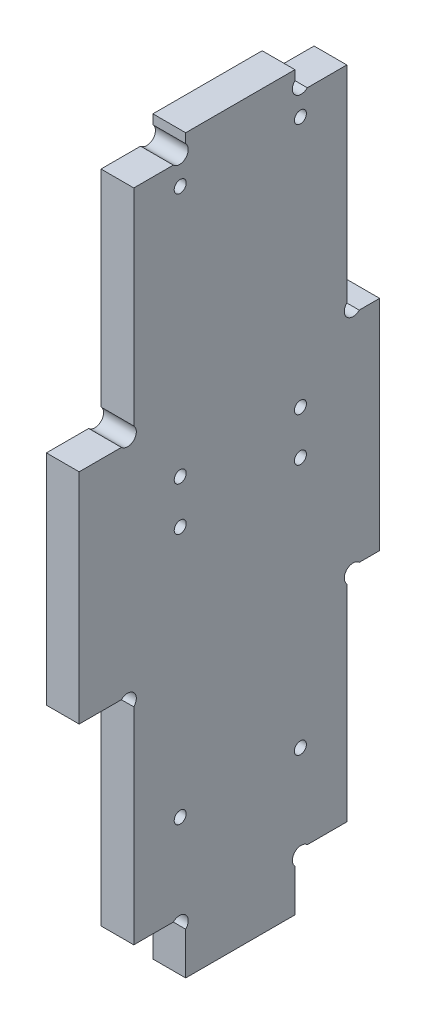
ISO-10303-21;
HEADER;
FILE_DESCRIPTION(('STEP AP214'),'2;1');
FILE_NAME('part.step','',(''),(''),'','','');
FILE_SCHEMA(('AUTOMOTIVE_DESIGN { 1 0 10303 214 1 1 1 1 }'));
ENDSEC;
DATA;
#1=APPLICATION_CONTEXT('core data for automotive mechanical design processes');
#2=APPLICATION_PROTOCOL_DEFINITION('international standard','automotive_design',2000,#1);
#3=PRODUCT_CONTEXT('',#1,'mechanical');
#4=PRODUCT('Part','Part','',(#3));
#5=PRODUCT_RELATED_PRODUCT_CATEGORY('part','',(#4));
#6=PRODUCT_DEFINITION_FORMATION('','',#4);
#7=PRODUCT_DEFINITION_CONTEXT('part definition',#1,'design');
#8=PRODUCT_DEFINITION('design','',#6,#7);
#9=PRODUCT_DEFINITION_SHAPE('','',#8);
#10=(LENGTH_UNIT() NAMED_UNIT(*) SI_UNIT(.MILLI.,.METRE.));
#11=(NAMED_UNIT(*) PLANE_ANGLE_UNIT() SI_UNIT($,.RADIAN.));
#12=(NAMED_UNIT(*) SI_UNIT($,.STERADIAN.) SOLID_ANGLE_UNIT());
#13=UNCERTAINTY_MEASURE_WITH_UNIT(LENGTH_MEASURE(1.E-05),#10,'distance_accuracy_value','');
#14=(GEOMETRIC_REPRESENTATION_CONTEXT(3) GLOBAL_UNCERTAINTY_ASSIGNED_CONTEXT((#13)) GLOBAL_UNIT_ASSIGNED_CONTEXT((#10,
#11,#12)) REPRESENTATION_CONTEXT('',''));
#15=CARTESIAN_POINT('',(0.,0.,0.));
#16=DIRECTION('',(0.,0.,1.));
#17=DIRECTION('',(1.,0.,0.));
#18=AXIS2_PLACEMENT_3D('',#15,#16,#17);
#19=CARTESIAN_POINT('',(6.,48.8686291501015,-50.1313708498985));
#20=DIRECTION('',(1.,0.,0.));
#21=DIRECTION('',(0.,0.,-1.));
#22=AXIS2_PLACEMENT_3D('',#19,#20,#21);
#23=PLANE('',#22);
#24=CARTESIAN_POINT('',(6.,26.,-40.5));
#25=DIRECTION('',(1.,0.,0.));
#26=DIRECTION('',(0.,0.,-1.));
#27=AXIS2_PLACEMENT_3D('',#24,#25,#26);
#28=CIRCLE('',#27,1.1);
#29=CARTESIAN_POINT('',(6.,26.,-41.6));
#30=VERTEX_POINT('',#29);
#31=EDGE_CURVE('E611',#30,#30,#28,.T.);
#32=ORIENTED_EDGE('',*,*,#31,.F.);
#33=EDGE_LOOP('',(#32));
#34=FACE_BOUND('',#33,.T.);
#35=CARTESIAN_POINT('',(6.,72.,-18.5));
#36=DIRECTION('',(1.,0.,0.));
#37=DIRECTION('',(0.,0.,1.));
#38=AXIS2_PLACEMENT_3D('',#35,#36,#37);
#39=CIRCLE('',#38,1.1);
#40=CARTESIAN_POINT('',(6.,72.,-17.4));
#41=VERTEX_POINT('',#40);
#42=EDGE_CURVE('E623',#41,#41,#39,.T.);
#43=ORIENTED_EDGE('',*,*,#42,.F.);
#44=EDGE_LOOP('',(#43));
#45=FACE_BOUND('',#44,.T.);
#46=CARTESIAN_POINT('',(6.,126.,-40.5));
#47=DIRECTION('',(1.,0.,0.));
#48=DIRECTION('',(0.,0.,1.));
#49=AXIS2_PLACEMENT_3D('',#46,#47,#48);
#50=CIRCLE('',#49,1.1);
#51=CARTESIAN_POINT('',(6.,126.,-39.4));
#52=VERTEX_POINT('',#51);
#53=EDGE_CURVE('E635',#52,#52,#50,.T.);
#54=ORIENTED_EDGE('',*,*,#53,.F.);
#55=EDGE_LOOP('',(#54));
#56=FACE_BOUND('',#55,.T.);
#57=CARTESIAN_POINT('',(6.,126.,-18.5));
#58=DIRECTION('',(1.,0.,0.));
#59=DIRECTION('',(0.,0.,-1.));
#60=AXIS2_PLACEMENT_3D('',#57,#58,#59);
#61=CIRCLE('',#60,1.1);
#62=CARTESIAN_POINT('',(6.,126.,-19.6));
#63=VERTEX_POINT('',#62);
#64=EDGE_CURVE('E237',#63,#63,#61,.T.);
#65=ORIENTED_EDGE('',*,*,#64,.F.);
#66=EDGE_LOOP('',(#65));
#67=FACE_BOUND('',#66,.T.);
#68=CARTESIAN_POINT('',(6.,48.8686291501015,-50.1313708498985));
#69=DIRECTION('',(-1.,0.,0.));
#70=DIRECTION('',(0.,0.,-1.));
#71=AXIS2_PLACEMENT_3D('',#68,#69,#70);
#72=CIRCLE('',#71,1.6);
#73=CARTESIAN_POINT('',(6.,47.7372583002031,-49.));
#74=VERTEX_POINT('',#73);
#75=CARTESIAN_POINT('',(6.,50.,-51.262741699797));
#76=VERTEX_POINT('',#75);
#77=EDGE_CURVE('E295',#74,#76,#72,.T.);
#78=ORIENTED_EDGE('',*,*,#77,.T.);
#79=DIRECTION('',(0.,0.,-1.));
#80=VECTOR('',#79,1.);
#81=CARTESIAN_POINT('',(6.,50.,-51.262741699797));
#82=LINE('',#81,#80);
#83=CARTESIAN_POINT('',(6.,50.,-55.));
#84=VERTEX_POINT('',#83);
#85=EDGE_CURVE('E232',#76,#84,#82,.T.);
#86=ORIENTED_EDGE('',*,*,#85,.T.);
#87=DIRECTION('',(0.,1.,0.));
#88=VECTOR('',#87,1.);
#89=CARTESIAN_POINT('',(6.,90.,-55.));
#90=LINE('',#89,#88);
#91=CARTESIAN_POINT('',(6.,90.,-55.));
#92=VERTEX_POINT('',#91);
#93=EDGE_CURVE('E298',#84,#92,#90,.T.);
#94=ORIENTED_EDGE('',*,*,#93,.T.);
#95=DIRECTION('',(0.,0.,1.));
#96=VECTOR('',#95,1.);
#97=CARTESIAN_POINT('',(6.,90.,-51.262741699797));
#98=LINE('',#97,#96);
#99=CARTESIAN_POINT('',(6.,90.,-51.262741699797));
#100=VERTEX_POINT('',#99);
#101=EDGE_CURVE('E300',#92,#100,#98,.T.);
#102=ORIENTED_EDGE('',*,*,#101,.T.);
#103=CARTESIAN_POINT('',(6.,91.1313708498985,-50.1313708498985));
#104=DIRECTION('',(-1.,0.,0.));
#105=DIRECTION('',(0.,0.,1.));
#106=AXIS2_PLACEMENT_3D('',#103,#104,#105);
#107=CIRCLE('',#106,1.59999999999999);
#108=CARTESIAN_POINT('',(6.,92.2627416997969,-49.));
#109=VERTEX_POINT('',#108);
#110=EDGE_CURVE('E302',#100,#109,#107,.T.);
#111=ORIENTED_EDGE('',*,*,#110,.T.);
#112=DIRECTION('',(0.,1.,0.));
#113=VECTOR('',#112,1.);
#114=CARTESIAN_POINT('',(6.,130.,-49.));
#115=LINE('',#114,#113);
#116=CARTESIAN_POINT('',(6.,130.,-49.));
#117=VERTEX_POINT('',#116);
#118=EDGE_CURVE('E304',#109,#117,#115,.T.);
#119=ORIENTED_EDGE('',*,*,#118,.T.);
#120=DIRECTION('',(0.,0.,1.));
#121=VECTOR('',#120,1.);
#122=CARTESIAN_POINT('',(6.,130.,-41.7627416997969));
#123=LINE('',#122,#121);
#124=CARTESIAN_POINT('',(6.,130.,-41.7627416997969));
#125=VERTEX_POINT('',#124);
#126=EDGE_CURVE('E306',#117,#125,#123,.T.);
#127=ORIENTED_EDGE('',*,*,#126,.T.);
#128=CARTESIAN_POINT('',(6.,131.131370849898,-40.6313708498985));
#129=DIRECTION('',(-1.,0.,0.));
#130=DIRECTION('',(0.,0.,1.));
#131=AXIS2_PLACEMENT_3D('',#128,#129,#130);
#132=CIRCLE('',#131,1.59999999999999);
#133=CARTESIAN_POINT('',(6.,132.262741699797,-39.5));
#134=VERTEX_POINT('',#133);
#135=EDGE_CURVE('E308',#125,#134,#132,.T.);
#136=ORIENTED_EDGE('',*,*,#135,.T.);
#137=DIRECTION('',(0.,1.,0.));
#138=VECTOR('',#137,1.);
#139=CARTESIAN_POINT('',(6.,132.262741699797,-39.5));
#140=LINE('',#139,#138);
#141=CARTESIAN_POINT('',(6.,134.,-39.5));
#142=VERTEX_POINT('',#141);
#143=EDGE_CURVE('E310',#134,#142,#140,.T.);
#144=ORIENTED_EDGE('',*,*,#143,.T.);
#145=DIRECTION('',(0.,0.,1.));
#146=VECTOR('',#145,1.);
#147=CARTESIAN_POINT('',(6.,134.,-19.5));
#148=LINE('',#147,#146);
#149=CARTESIAN_POINT('',(6.,134.,-19.5));
#150=VERTEX_POINT('',#149);
#151=EDGE_CURVE('E312',#142,#150,#148,.T.);
#152=ORIENTED_EDGE('',*,*,#151,.T.);
#153=DIRECTION('',(0.,-1.,0.));
#154=VECTOR('',#153,1.);
#155=CARTESIAN_POINT('',(6.,132.262741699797,-19.5));
#156=LINE('',#155,#154);
#157=CARTESIAN_POINT('',(6.,132.262741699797,-19.5));
#158=VERTEX_POINT('',#157);
#159=EDGE_CURVE('E314',#150,#158,#156,.T.);
#160=ORIENTED_EDGE('',*,*,#159,.T.);
#161=CARTESIAN_POINT('',(6.,131.131370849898,-18.3686291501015));
#162=DIRECTION('',(-1.,0.,0.));
#163=DIRECTION('',(0.,0.,-1.));
#164=AXIS2_PLACEMENT_3D('',#161,#162,#163);
#165=CIRCLE('',#164,1.59999999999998);
#166=CARTESIAN_POINT('',(6.,130.,-17.2372583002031));
#167=VERTEX_POINT('',#166);
#168=EDGE_CURVE('E316',#158,#167,#165,.T.);
#169=ORIENTED_EDGE('',*,*,#168,.T.);
#170=DIRECTION('',(0.,0.,1.));
#171=VECTOR('',#170,1.);
#172=CARTESIAN_POINT('',(6.,130.,-10.));
#173=LINE('',#172,#171);
#174=CARTESIAN_POINT('',(6.,130.,-10.));
#175=VERTEX_POINT('',#174);
#176=EDGE_CURVE('E318',#167,#175,#173,.T.);
#177=ORIENTED_EDGE('',*,*,#176,.T.);
#178=DIRECTION('',(0.,-1.,0.));
#179=VECTOR('',#178,1.);
#180=CARTESIAN_POINT('',(6.,92.2627416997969,-10.));
#181=LINE('',#180,#179);
#182=CARTESIAN_POINT('',(6.,92.2627416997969,-10.));
#183=VERTEX_POINT('',#182);
#184=EDGE_CURVE('E320',#175,#183,#181,.T.);
#185=ORIENTED_EDGE('',*,*,#184,.T.);
#186=CARTESIAN_POINT('',(6.,91.1313708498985,-8.86862915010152));
#187=DIRECTION('',(-1.,0.,0.));
#188=DIRECTION('',(0.,0.,1.));
#189=AXIS2_PLACEMENT_3D('',#186,#187,#188);
#190=CIRCLE('',#189,1.6);
#191=CARTESIAN_POINT('',(6.,90.,-7.73725830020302));
#192=VERTEX_POINT('',#191);
#193=EDGE_CURVE('E322',#183,#192,#190,.T.);
#194=ORIENTED_EDGE('',*,*,#193,.T.);
#195=DIRECTION('',(0.,0.,1.));
#196=VECTOR('',#195,1.);
#197=CARTESIAN_POINT('',(6.,90.,-7.73725830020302));
#198=LINE('',#197,#196);
#199=CARTESIAN_POINT('',(6.,90.,0.));
#200=VERTEX_POINT('',#199);
#201=EDGE_CURVE('E324',#192,#200,#198,.T.);
#202=ORIENTED_EDGE('',*,*,#201,.T.);
#203=DIRECTION('',(0.,-1.,0.));
#204=VECTOR('',#203,1.);
#205=CARTESIAN_POINT('',(6.,50.,0.));
#206=LINE('',#205,#204);
#207=CARTESIAN_POINT('',(6.,50.,0.));
#208=VERTEX_POINT('',#207);
#209=EDGE_CURVE('E326',#200,#208,#206,.T.);
#210=ORIENTED_EDGE('',*,*,#209,.T.);
#211=DIRECTION('',(0.,0.,-1.));
#212=VECTOR('',#211,1.);
#213=CARTESIAN_POINT('',(6.,50.,-7.73725830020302));
#214=LINE('',#213,#212);
#215=CARTESIAN_POINT('',(6.,50.,-7.73725830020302));
#216=VERTEX_POINT('',#215);
#217=EDGE_CURVE('E328',#208,#216,#214,.T.);
#218=ORIENTED_EDGE('',*,*,#217,.T.);
#219=CARTESIAN_POINT('',(6.,48.8686291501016,-8.86862915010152));
#220=DIRECTION('',(-1.,0.,0.));
#221=DIRECTION('',(0.,0.,-1.));
#222=AXIS2_PLACEMENT_3D('',#219,#220,#221);
#223=CIRCLE('',#222,1.6);
#224=CARTESIAN_POINT('',(6.,47.7372583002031,-10.));
#225=VERTEX_POINT('',#224);
#226=EDGE_CURVE('E330',#216,#225,#223,.T.);
#227=ORIENTED_EDGE('',*,*,#226,.T.);
#228=DIRECTION('',(0.,-1.,0.));
#229=VECTOR('',#228,1.);
#230=CARTESIAN_POINT('',(6.,10.,-10.));
#231=LINE('',#230,#229);
#232=CARTESIAN_POINT('',(6.,10.,-10.));
#233=VERTEX_POINT('',#232);
#234=EDGE_CURVE('E332',#225,#233,#231,.T.);
#235=ORIENTED_EDGE('',*,*,#234,.T.);
#236=DIRECTION('',(0.,0.,-1.));
#237=VECTOR('',#236,1.);
#238=CARTESIAN_POINT('',(6.,10.,-17.237258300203));
#239=LINE('',#238,#237);
#240=CARTESIAN_POINT('',(6.,10.,-17.237258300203));
#241=VERTEX_POINT('',#240);
#242=EDGE_CURVE('E334',#233,#241,#239,.T.);
#243=ORIENTED_EDGE('',*,*,#242,.T.);
#244=CARTESIAN_POINT('',(6.,8.86862915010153,-18.3686291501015));
#245=DIRECTION('',(-1.,0.,0.));
#246=DIRECTION('',(0.,0.,-1.));
#247=AXIS2_PLACEMENT_3D('',#244,#245,#246);
#248=CIRCLE('',#247,1.6);
#249=CARTESIAN_POINT('',(6.,7.73725830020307,-19.5));
#250=VERTEX_POINT('',#249);
#251=EDGE_CURVE('E336',#241,#250,#248,.T.);
#252=ORIENTED_EDGE('',*,*,#251,.T.);
#253=DIRECTION('',(0.,-1.,0.));
#254=VECTOR('',#253,1.);
#255=CARTESIAN_POINT('',(6.,7.73725830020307,-19.5));
#256=LINE('',#255,#254);
#257=CARTESIAN_POINT('',(6.,0.,-19.5));
#258=VERTEX_POINT('',#257);
#259=EDGE_CURVE('E338',#250,#258,#256,.T.);
#260=ORIENTED_EDGE('',*,*,#259,.T.);
#261=DIRECTION('',(0.,0.,-1.));
#262=VECTOR('',#261,1.);
#263=CARTESIAN_POINT('',(6.,0.,-19.5));
#264=LINE('',#263,#262);
#265=CARTESIAN_POINT('',(6.,0.,-39.5));
#266=VERTEX_POINT('',#265);
#267=EDGE_CURVE('E340',#258,#266,#264,.T.);
#268=ORIENTED_EDGE('',*,*,#267,.T.);
#269=DIRECTION('',(0.,1.,0.));
#270=VECTOR('',#269,1.);
#271=CARTESIAN_POINT('',(6.,7.73725830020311,-39.5));
#272=LINE('',#271,#270);
#273=CARTESIAN_POINT('',(6.,7.73725830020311,-39.5));
#274=VERTEX_POINT('',#273);
#275=EDGE_CURVE('E342',#266,#274,#272,.T.);
#276=ORIENTED_EDGE('',*,*,#275,.T.);
#277=CARTESIAN_POINT('',(6.,8.86862915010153,-40.6313708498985));
#278=DIRECTION('',(-1.,0.,0.));
#279=DIRECTION('',(0.,0.,1.));
#280=AXIS2_PLACEMENT_3D('',#277,#278,#279);
#281=CIRCLE('',#280,1.6);
#282=CARTESIAN_POINT('',(6.,10.,-41.762741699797));
#283=VERTEX_POINT('',#282);
#284=EDGE_CURVE('E344',#274,#283,#281,.T.);
#285=ORIENTED_EDGE('',*,*,#284,.T.);
#286=DIRECTION('',(0.,0.,-1.));
#287=VECTOR('',#286,1.);
#288=CARTESIAN_POINT('',(6.,10.,-41.762741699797));
#289=LINE('',#288,#287);
#290=CARTESIAN_POINT('',(6.,10.,-49.));
#291=VERTEX_POINT('',#290);
#292=EDGE_CURVE('E53',#283,#291,#289,.T.);
#293=ORIENTED_EDGE('',*,*,#292,.T.);
#294=DIRECTION('',(0.,1.,0.));
#295=VECTOR('',#294,1.);
#296=CARTESIAN_POINT('',(6.,10.,-49.));
#297=LINE('',#296,#295);
#298=EDGE_CURVE('E48',#291,#74,#297,.T.);
#299=ORIENTED_EDGE('',*,*,#298,.T.);
#300=EDGE_LOOP('',(#78,#86,#94,#102,#111,#119,#127,#136,#144,#152,#160,#169,#177,#185,#194,#202,
#210,#218,#227,#235,#243,#252,#260,#268,#276,#285,#293,#299));
#301=FACE_BOUND('',#300,.T.);
#302=CARTESIAN_POINT('',(6.,80.,-18.5));
#303=DIRECTION('',(1.,0.,0.));
#304=DIRECTION('',(0.,0.,-1.));
#305=AXIS2_PLACEMENT_3D('',#302,#303,#304);
#306=CIRCLE('',#305,1.1);
#307=CARTESIAN_POINT('',(6.,80.,-19.6));
#308=VERTEX_POINT('',#307);
#309=EDGE_CURVE('E641',#308,#308,#306,.T.);
#310=ORIENTED_EDGE('',*,*,#309,.F.);
#311=EDGE_LOOP('',(#310));
#312=FACE_BOUND('',#311,.T.);
#313=CARTESIAN_POINT('',(6.,80.,-40.5));
#314=DIRECTION('',(1.,0.,0.));
#315=DIRECTION('',(0.,0.,1.));
#316=AXIS2_PLACEMENT_3D('',#313,#314,#315);
#317=CIRCLE('',#316,1.09999999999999);
#318=CARTESIAN_POINT('',(6.,80.,-39.4));
#319=VERTEX_POINT('',#318);
#320=EDGE_CURVE('E629',#319,#319,#317,.T.);
#321=ORIENTED_EDGE('',*,*,#320,.F.);
#322=EDGE_LOOP('',(#321));
#323=FACE_BOUND('',#322,.T.);
#324=CARTESIAN_POINT('',(6.,72.,-40.5));
#325=DIRECTION('',(1.,0.,0.));
#326=DIRECTION('',(0.,0.,-1.));
#327=AXIS2_PLACEMENT_3D('',#324,#325,#326);
#328=CIRCLE('',#327,1.09999999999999);
#329=CARTESIAN_POINT('',(6.,72.,-41.6));
#330=VERTEX_POINT('',#329);
#331=EDGE_CURVE('E617',#330,#330,#328,.T.);
#332=ORIENTED_EDGE('',*,*,#331,.F.);
#333=EDGE_LOOP('',(#332));
#334=FACE_BOUND('',#333,.T.);
#335=CARTESIAN_POINT('',(6.,26.,-18.5));
#336=DIRECTION('',(1.,0.,0.));
#337=DIRECTION('',(0.,0.,1.));
#338=AXIS2_PLACEMENT_3D('',#335,#336,#337);
#339=CIRCLE('',#338,1.1);
#340=CARTESIAN_POINT('',(6.,26.,-17.4));
#341=VERTEX_POINT('',#340);
#342=EDGE_CURVE('E600',#341,#341,#339,.T.);
#343=ORIENTED_EDGE('',*,*,#342,.F.);
#344=EDGE_LOOP('',(#343));
#345=FACE_BOUND('',#344,.T.);
#346=ADVANCED_FACE('F33',(#34,#45,#56,#67,#301,#312,#323,#334,#345),#23,.T.);
#347=CARTESIAN_POINT('',(0.,48.8686291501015,-50.1313708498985));
#348=DIRECTION('',(1.,0.,0.));
#349=DIRECTION('',(0.,0.,-1.));
#350=AXIS2_PLACEMENT_3D('',#347,#348,#349);
#351=PLANE('',#350);
#352=CARTESIAN_POINT('',(0.,26.,-40.5));
#353=DIRECTION('',(1.,0.,0.));
#354=DIRECTION('',(0.,0.,-1.));
#355=AXIS2_PLACEMENT_3D('',#352,#353,#354);
#356=CIRCLE('',#355,1.1);
#357=CARTESIAN_POINT('',(0.,26.,-41.6));
#358=VERTEX_POINT('',#357);
#359=EDGE_CURVE('E606',#358,#358,#356,.T.);
#360=ORIENTED_EDGE('',*,*,#359,.T.);
#361=EDGE_LOOP('',(#360));
#362=FACE_BOUND('',#361,.T.);
#363=CARTESIAN_POINT('',(0.,72.,-18.5));
#364=DIRECTION('',(1.,0.,0.));
#365=DIRECTION('',(0.,0.,1.));
#366=AXIS2_PLACEMENT_3D('',#363,#364,#365);
#367=CIRCLE('',#366,1.1);
#368=CARTESIAN_POINT('',(0.,72.,-17.4));
#369=VERTEX_POINT('',#368);
#370=EDGE_CURVE('E620',#369,#369,#367,.T.);
#371=ORIENTED_EDGE('',*,*,#370,.T.);
#372=EDGE_LOOP('',(#371));
#373=FACE_BOUND('',#372,.T.);
#374=CARTESIAN_POINT('',(0.,126.,-40.5));
#375=DIRECTION('',(1.,0.,0.));
#376=DIRECTION('',(0.,0.,1.));
#377=AXIS2_PLACEMENT_3D('',#374,#375,#376);
#378=CIRCLE('',#377,1.1);
#379=CARTESIAN_POINT('',(0.,126.,-39.4));
#380=VERTEX_POINT('',#379);
#381=EDGE_CURVE('E632',#380,#380,#378,.T.);
#382=ORIENTED_EDGE('',*,*,#381,.T.);
#383=EDGE_LOOP('',(#382));
#384=FACE_BOUND('',#383,.T.);
#385=CARTESIAN_POINT('',(0.,126.,-18.5));
#386=DIRECTION('',(1.,0.,0.));
#387=DIRECTION('',(0.,0.,-1.));
#388=AXIS2_PLACEMENT_3D('',#385,#386,#387);
#389=CIRCLE('',#388,1.1);
#390=CARTESIAN_POINT('',(0.,126.,-19.6));
#391=VERTEX_POINT('',#390);
#392=EDGE_CURVE('E240',#391,#391,#389,.T.);
#393=ORIENTED_EDGE('',*,*,#392,.T.);
#394=EDGE_LOOP('',(#393));
#395=FACE_BOUND('',#394,.T.);
#396=CARTESIAN_POINT('',(0.,48.8686291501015,-50.1313708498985));
#397=DIRECTION('',(-1.,0.,0.));
#398=DIRECTION('',(0.,0.,-1.));
#399=AXIS2_PLACEMENT_3D('',#396,#397,#398);
#400=CIRCLE('',#399,1.6);
#401=CARTESIAN_POINT('',(0.,47.7372583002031,-49.));
#402=VERTEX_POINT('',#401);
#403=CARTESIAN_POINT('',(0.,50.,-51.262741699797));
#404=VERTEX_POINT('',#403);
#405=EDGE_CURVE('E223',#402,#404,#400,.T.);
#406=ORIENTED_EDGE('',*,*,#405,.F.);
#407=DIRECTION('',(0.,1.,0.));
#408=VECTOR('',#407,1.);
#409=CARTESIAN_POINT('',(0.,10.,-49.));
#410=LINE('',#409,#408);
#411=CARTESIAN_POINT('',(0.,10.,-49.));
#412=VERTEX_POINT('',#411);
#413=EDGE_CURVE('E293',#412,#402,#410,.T.);
#414=ORIENTED_EDGE('',*,*,#413,.F.);
#415=DIRECTION('',(0.,0.,-1.));
#416=VECTOR('',#415,1.);
#417=CARTESIAN_POINT('',(0.,10.,-41.762741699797));
#418=LINE('',#417,#416);
#419=CARTESIAN_POINT('',(0.,10.,-41.762741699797));
#420=VERTEX_POINT('',#419);
#421=EDGE_CURVE('E291',#420,#412,#418,.T.);
#422=ORIENTED_EDGE('',*,*,#421,.F.);
#423=CARTESIAN_POINT('',(0.,8.86862915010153,-40.6313708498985));
#424=DIRECTION('',(-1.,0.,0.));
#425=DIRECTION('',(0.,0.,1.));
#426=AXIS2_PLACEMENT_3D('',#423,#424,#425);
#427=CIRCLE('',#426,1.6);
#428=CARTESIAN_POINT('',(0.,7.73725830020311,-39.5));
#429=VERTEX_POINT('',#428);
#430=EDGE_CURVE('E289',#429,#420,#427,.T.);
#431=ORIENTED_EDGE('',*,*,#430,.F.);
#432=DIRECTION('',(0.,1.,0.));
#433=VECTOR('',#432,1.);
#434=CARTESIAN_POINT('',(0.,7.73725830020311,-39.5));
#435=LINE('',#434,#433);
#436=CARTESIAN_POINT('',(0.,0.,-39.5));
#437=VERTEX_POINT('',#436);
#438=EDGE_CURVE('E287',#437,#429,#435,.T.);
#439=ORIENTED_EDGE('',*,*,#438,.F.);
#440=DIRECTION('',(0.,0.,-1.));
#441=VECTOR('',#440,1.);
#442=CARTESIAN_POINT('',(0.,0.,-19.5));
#443=LINE('',#442,#441);
#444=CARTESIAN_POINT('',(0.,0.,-19.5));
#445=VERTEX_POINT('',#444);
#446=EDGE_CURVE('E285',#445,#437,#443,.T.);
#447=ORIENTED_EDGE('',*,*,#446,.F.);
#448=DIRECTION('',(0.,-1.,0.));
#449=VECTOR('',#448,1.);
#450=CARTESIAN_POINT('',(0.,7.73725830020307,-19.5));
#451=LINE('',#450,#449);
#452=CARTESIAN_POINT('',(0.,7.73725830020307,-19.5));
#453=VERTEX_POINT('',#452);
#454=EDGE_CURVE('E283',#453,#445,#451,.T.);
#455=ORIENTED_EDGE('',*,*,#454,.F.);
#456=CARTESIAN_POINT('',(0.,8.86862915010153,-18.3686291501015));
#457=DIRECTION('',(-1.,0.,0.));
#458=DIRECTION('',(0.,0.,-1.));
#459=AXIS2_PLACEMENT_3D('',#456,#457,#458);
#460=CIRCLE('',#459,1.6);
#461=CARTESIAN_POINT('',(0.,10.,-17.237258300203));
#462=VERTEX_POINT('',#461);
#463=EDGE_CURVE('E281',#462,#453,#460,.T.);
#464=ORIENTED_EDGE('',*,*,#463,.F.);
#465=DIRECTION('',(0.,0.,-1.));
#466=VECTOR('',#465,1.);
#467=CARTESIAN_POINT('',(0.,10.,-17.237258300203));
#468=LINE('',#467,#466);
#469=CARTESIAN_POINT('',(0.,10.,-10.));
#470=VERTEX_POINT('',#469);
#471=EDGE_CURVE('E279',#470,#462,#468,.T.);
#472=ORIENTED_EDGE('',*,*,#471,.F.);
#473=DIRECTION('',(0.,-1.,0.));
#474=VECTOR('',#473,1.);
#475=CARTESIAN_POINT('',(0.,10.,-10.));
#476=LINE('',#475,#474);
#477=CARTESIAN_POINT('',(0.,47.7372583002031,-10.));
#478=VERTEX_POINT('',#477);
#479=EDGE_CURVE('E277',#478,#470,#476,.T.);
#480=ORIENTED_EDGE('',*,*,#479,.F.);
#481=CARTESIAN_POINT('',(0.,48.8686291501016,-8.86862915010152));
#482=DIRECTION('',(-1.,0.,0.));
#483=DIRECTION('',(0.,0.,-1.));
#484=AXIS2_PLACEMENT_3D('',#481,#482,#483);
#485=CIRCLE('',#484,1.6);
#486=CARTESIAN_POINT('',(0.,50.,-7.73725830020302));
#487=VERTEX_POINT('',#486);
#488=EDGE_CURVE('E275',#487,#478,#485,.T.);
#489=ORIENTED_EDGE('',*,*,#488,.F.);
#490=DIRECTION('',(0.,0.,-1.));
#491=VECTOR('',#490,1.);
#492=CARTESIAN_POINT('',(0.,50.,-7.73725830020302));
#493=LINE('',#492,#491);
#494=CARTESIAN_POINT('',(0.,50.,0.));
#495=VERTEX_POINT('',#494);
#496=EDGE_CURVE('E273',#495,#487,#493,.T.);
#497=ORIENTED_EDGE('',*,*,#496,.F.);
#498=DIRECTION('',(0.,-1.,0.));
#499=VECTOR('',#498,1.);
#500=CARTESIAN_POINT('',(0.,50.,0.));
#501=LINE('',#500,#499);
#502=CARTESIAN_POINT('',(0.,90.,0.));
#503=VERTEX_POINT('',#502);
#504=EDGE_CURVE('E271',#503,#495,#501,.T.);
#505=ORIENTED_EDGE('',*,*,#504,.F.);
#506=DIRECTION('',(0.,0.,1.));
#507=VECTOR('',#506,1.);
#508=CARTESIAN_POINT('',(0.,90.,-7.73725830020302));
#509=LINE('',#508,#507);
#510=CARTESIAN_POINT('',(0.,90.,-7.73725830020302));
#511=VERTEX_POINT('',#510);
#512=EDGE_CURVE('E269',#511,#503,#509,.T.);
#513=ORIENTED_EDGE('',*,*,#512,.F.);
#514=CARTESIAN_POINT('',(0.,91.1313708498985,-8.86862915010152));
#515=DIRECTION('',(-1.,0.,0.));
#516=DIRECTION('',(0.,0.,1.));
#517=AXIS2_PLACEMENT_3D('',#514,#515,#516);
#518=CIRCLE('',#517,1.6);
#519=CARTESIAN_POINT('',(0.,92.2627416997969,-10.));
#520=VERTEX_POINT('',#519);
#521=EDGE_CURVE('E267',#520,#511,#518,.T.);
#522=ORIENTED_EDGE('',*,*,#521,.F.);
#523=DIRECTION('',(0.,-1.,0.));
#524=VECTOR('',#523,1.);
#525=CARTESIAN_POINT('',(0.,92.2627416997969,-10.));
#526=LINE('',#525,#524);
#527=CARTESIAN_POINT('',(0.,130.,-10.));
#528=VERTEX_POINT('',#527);
#529=EDGE_CURVE('E265',#528,#520,#526,.T.);
#530=ORIENTED_EDGE('',*,*,#529,.F.);
#531=DIRECTION('',(0.,0.,1.));
#532=VECTOR('',#531,1.);
#533=CARTESIAN_POINT('',(0.,130.,-10.));
#534=LINE('',#533,#532);
#535=CARTESIAN_POINT('',(0.,130.,-17.2372583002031));
#536=VERTEX_POINT('',#535);
#537=EDGE_CURVE('E263',#536,#528,#534,.T.);
#538=ORIENTED_EDGE('',*,*,#537,.F.);
#539=CARTESIAN_POINT('',(0.,131.131370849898,-18.3686291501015));
#540=DIRECTION('',(-1.,0.,0.));
#541=DIRECTION('',(0.,0.,-1.));
#542=AXIS2_PLACEMENT_3D('',#539,#540,#541);
#543=CIRCLE('',#542,1.59999999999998);
#544=CARTESIAN_POINT('',(0.,132.262741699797,-19.5));
#545=VERTEX_POINT('',#544);
#546=EDGE_CURVE('E261',#545,#536,#543,.T.);
#547=ORIENTED_EDGE('',*,*,#546,.F.);
#548=DIRECTION('',(0.,-1.,0.));
#549=VECTOR('',#548,1.);
#550=CARTESIAN_POINT('',(0.,132.262741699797,-19.5));
#551=LINE('',#550,#549);
#552=CARTESIAN_POINT('',(0.,134.,-19.5));
#553=VERTEX_POINT('',#552);
#554=EDGE_CURVE('E259',#553,#545,#551,.T.);
#555=ORIENTED_EDGE('',*,*,#554,.F.);
#556=DIRECTION('',(0.,0.,1.));
#557=VECTOR('',#556,1.);
#558=CARTESIAN_POINT('',(0.,134.,-19.5));
#559=LINE('',#558,#557);
#560=CARTESIAN_POINT('',(0.,134.,-39.5));
#561=VERTEX_POINT('',#560);
#562=EDGE_CURVE('E257',#561,#553,#559,.T.);
#563=ORIENTED_EDGE('',*,*,#562,.F.);
#564=DIRECTION('',(0.,1.,0.));
#565=VECTOR('',#564,1.);
#566=CARTESIAN_POINT('',(0.,132.262741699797,-39.5));
#567=LINE('',#566,#565);
#568=CARTESIAN_POINT('',(0.,132.262741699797,-39.5));
#569=VERTEX_POINT('',#568);
#570=EDGE_CURVE('E255',#569,#561,#567,.T.);
#571=ORIENTED_EDGE('',*,*,#570,.F.);
#572=CARTESIAN_POINT('',(0.,131.131370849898,-40.6313708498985));
#573=DIRECTION('',(-1.,0.,0.));
#574=DIRECTION('',(0.,0.,1.));
#575=AXIS2_PLACEMENT_3D('',#572,#573,#574);
#576=CIRCLE('',#575,1.59999999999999);
#577=CARTESIAN_POINT('',(0.,130.,-41.7627416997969));
#578=VERTEX_POINT('',#577);
#579=EDGE_CURVE('E253',#578,#569,#576,.T.);
#580=ORIENTED_EDGE('',*,*,#579,.F.);
#581=DIRECTION('',(0.,0.,1.));
#582=VECTOR('',#581,1.);
#583=CARTESIAN_POINT('',(0.,130.,-41.7627416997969));
#584=LINE('',#583,#582);
#585=CARTESIAN_POINT('',(0.,130.,-49.));
#586=VERTEX_POINT('',#585);
#587=EDGE_CURVE('E251',#586,#578,#584,.T.);
#588=ORIENTED_EDGE('',*,*,#587,.F.);
#589=DIRECTION('',(0.,1.,0.));
#590=VECTOR('',#589,1.);
#591=CARTESIAN_POINT('',(0.,130.,-49.));
#592=LINE('',#591,#590);
#593=CARTESIAN_POINT('',(0.,92.2627416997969,-49.));
#594=VERTEX_POINT('',#593);
#595=EDGE_CURVE('E249',#594,#586,#592,.T.);
#596=ORIENTED_EDGE('',*,*,#595,.F.);
#597=CARTESIAN_POINT('',(0.,91.1313708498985,-50.1313708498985));
#598=DIRECTION('',(-1.,0.,0.));
#599=DIRECTION('',(0.,0.,1.));
#600=AXIS2_PLACEMENT_3D('',#597,#598,#599);
#601=CIRCLE('',#600,1.59999999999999);
#602=CARTESIAN_POINT('',(0.,90.,-51.262741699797));
#603=VERTEX_POINT('',#602);
#604=EDGE_CURVE('E247',#603,#594,#601,.T.);
#605=ORIENTED_EDGE('',*,*,#604,.F.);
#606=DIRECTION('',(0.,0.,1.));
#607=VECTOR('',#606,1.);
#608=CARTESIAN_POINT('',(0.,90.,-51.262741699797));
#609=LINE('',#608,#607);
#610=CARTESIAN_POINT('',(0.,90.,-55.));
#611=VERTEX_POINT('',#610);
#612=EDGE_CURVE('E245',#611,#603,#609,.T.);
#613=ORIENTED_EDGE('',*,*,#612,.F.);
#614=DIRECTION('',(0.,1.,0.));
#615=VECTOR('',#614,1.);
#616=CARTESIAN_POINT('',(0.,90.,-55.));
#617=LINE('',#616,#615);
#618=CARTESIAN_POINT('',(0.,50.,-55.));
#619=VERTEX_POINT('',#618);
#620=EDGE_CURVE('E225',#619,#611,#617,.T.);
#621=ORIENTED_EDGE('',*,*,#620,.F.);
#622=DIRECTION('',(0.,0.,-1.));
#623=VECTOR('',#622,1.);
#624=CARTESIAN_POINT('',(0.,50.,-51.262741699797));
#625=LINE('',#624,#623);
#626=EDGE_CURVE('E218',#404,#619,#625,.T.);
#627=ORIENTED_EDGE('',*,*,#626,.F.);
#628=EDGE_LOOP('',(#406,#414,#422,#431,#439,#447,#455,#464,#472,#480,#489,#497,#505,#513,#522,
#530,#538,#547,#555,#563,#571,#580,#588,#596,#605,#613,#621,#627));
#629=FACE_BOUND('',#628,.T.);
#630=CARTESIAN_POINT('',(0.,80.,-18.5));
#631=DIRECTION('',(1.,0.,0.));
#632=DIRECTION('',(0.,0.,-1.));
#633=AXIS2_PLACEMENT_3D('',#630,#631,#632);
#634=CIRCLE('',#633,1.1);
#635=CARTESIAN_POINT('',(0.,80.,-19.6));
#636=VERTEX_POINT('',#635);
#637=EDGE_CURVE('E638',#636,#636,#634,.T.);
#638=ORIENTED_EDGE('',*,*,#637,.T.);
#639=EDGE_LOOP('',(#638));
#640=FACE_BOUND('',#639,.T.);
#641=CARTESIAN_POINT('',(0.,80.,-40.5));
#642=DIRECTION('',(1.,0.,0.));
#643=DIRECTION('',(0.,0.,1.));
#644=AXIS2_PLACEMENT_3D('',#641,#642,#643);
#645=CIRCLE('',#644,1.09999999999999);
#646=CARTESIAN_POINT('',(0.,80.,-39.4));
#647=VERTEX_POINT('',#646);
#648=EDGE_CURVE('E626',#647,#647,#645,.T.);
#649=ORIENTED_EDGE('',*,*,#648,.T.);
#650=EDGE_LOOP('',(#649));
#651=FACE_BOUND('',#650,.T.);
#652=CARTESIAN_POINT('',(0.,72.,-40.5));
#653=DIRECTION('',(1.,0.,0.));
#654=DIRECTION('',(0.,0.,-1.));
#655=AXIS2_PLACEMENT_3D('',#652,#653,#654);
#656=CIRCLE('',#655,1.09999999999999);
#657=CARTESIAN_POINT('',(0.,72.,-41.6));
#658=VERTEX_POINT('',#657);
#659=EDGE_CURVE('E614',#658,#658,#656,.T.);
#660=ORIENTED_EDGE('',*,*,#659,.T.);
#661=EDGE_LOOP('',(#660));
#662=FACE_BOUND('',#661,.T.);
#663=CARTESIAN_POINT('',(0.,26.,-18.5));
#664=DIRECTION('',(1.,0.,0.));
#665=DIRECTION('',(0.,0.,1.));
#666=AXIS2_PLACEMENT_3D('',#663,#664,#665);
#667=CIRCLE('',#666,1.1);
#668=CARTESIAN_POINT('',(0.,26.,-17.4));
#669=VERTEX_POINT('',#668);
#670=EDGE_CURVE('E603',#669,#669,#667,.T.);
#671=ORIENTED_EDGE('',*,*,#670,.T.);
#672=EDGE_LOOP('',(#671));
#673=FACE_BOUND('',#672,.T.);
#674=ADVANCED_FACE('F219',(#362,#373,#384,#395,#629,#640,#651,#662,#673),#351,.F.);
#675=CARTESIAN_POINT('',(6.,48.8686291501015,-50.1313708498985));
#676=DIRECTION('',(-1.,0.,0.));
#677=DIRECTION('',(0.,0.,1.));
#678=AXIS2_PLACEMENT_3D('',#675,#676,#677);
#679=CYLINDRICAL_SURFACE('',#678,1.6);
#680=ORIENTED_EDGE('',*,*,#405,.T.);
#681=DIRECTION('',(-1.,0.,0.));
#682=VECTOR('',#681,1.);
#683=CARTESIAN_POINT('',(6.,50.,-51.262741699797));
#684=LINE('',#683,#682);
#685=EDGE_CURVE('E11',#76,#404,#684,.T.);
#686=ORIENTED_EDGE('',*,*,#685,.F.);
#687=ORIENTED_EDGE('',*,*,#77,.F.);
#688=DIRECTION('',(-1.,0.,0.));
#689=VECTOR('',#688,1.);
#690=CARTESIAN_POINT('',(6.,47.7372583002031,-49.));
#691=LINE('',#690,#689);
#692=EDGE_CURVE('E236',#74,#402,#691,.T.);
#693=ORIENTED_EDGE('',*,*,#692,.T.);
#694=EDGE_LOOP('',(#680,#686,#687,#693));
#695=FACE_BOUND('',#694,.T.);
#696=ADVANCED_FACE('F35',(#695),#679,.F.);
#697=CARTESIAN_POINT('',(6.,50.,-51.262741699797));
#698=DIRECTION('',(0.,1.,0.));
#699=DIRECTION('',(0.,0.,1.));
#700=AXIS2_PLACEMENT_3D('',#697,#698,#699);
#701=PLANE('',#700);
#702=ORIENTED_EDGE('',*,*,#626,.T.);
#703=DIRECTION('',(-1.,0.,0.));
#704=VECTOR('',#703,1.);
#705=CARTESIAN_POINT('',(6.,50.,-55.));
#706=LINE('',#705,#704);
#707=EDGE_CURVE('E41',#84,#619,#706,.T.);
#708=ORIENTED_EDGE('',*,*,#707,.F.);
#709=ORIENTED_EDGE('',*,*,#85,.F.);
#710=ORIENTED_EDGE('',*,*,#685,.T.);
#711=EDGE_LOOP('',(#702,#708,#709,#710));
#712=FACE_BOUND('',#711,.T.);
#713=ADVANCED_FACE('F231',(#712),#701,.F.);
#714=CARTESIAN_POINT('',(6.,90.,-55.));
#715=DIRECTION('',(0.,0.,1.));
#716=DIRECTION('',(1.,0.,0.));
#717=AXIS2_PLACEMENT_3D('',#714,#715,#716);
#718=PLANE('',#717);
#719=ORIENTED_EDGE('',*,*,#620,.T.);
#720=DIRECTION('',(-1.,0.,0.));
#721=VECTOR('',#720,1.);
#722=CARTESIAN_POINT('',(6.,90.,-55.));
#723=LINE('',#722,#721);
#724=EDGE_CURVE('E421',#92,#611,#723,.T.);
#725=ORIENTED_EDGE('',*,*,#724,.F.);
#726=ORIENTED_EDGE('',*,*,#93,.F.);
#727=ORIENTED_EDGE('',*,*,#707,.T.);
#728=EDGE_LOOP('',(#719,#725,#726,#727));
#729=FACE_BOUND('',#728,.T.);
#730=ADVANCED_FACE('F425',(#729),#718,.F.);
#731=CARTESIAN_POINT('',(6.,90.,-51.262741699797));
#732=DIRECTION('',(0.,-1.,0.));
#733=DIRECTION('',(0.,0.,-1.));
#734=AXIS2_PLACEMENT_3D('',#731,#732,#733);
#735=PLANE('',#734);
#736=ORIENTED_EDGE('',*,*,#612,.T.);
#737=DIRECTION('',(-1.,0.,0.));
#738=VECTOR('',#737,1.);
#739=CARTESIAN_POINT('',(6.,90.,-51.262741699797));
#740=LINE('',#739,#738);
#741=EDGE_CURVE('E418',#100,#603,#740,.T.);
#742=ORIENTED_EDGE('',*,*,#741,.F.);
#743=ORIENTED_EDGE('',*,*,#101,.F.);
#744=ORIENTED_EDGE('',*,*,#724,.T.);
#745=EDGE_LOOP('',(#736,#742,#743,#744));
#746=FACE_BOUND('',#745,.T.);
#747=ADVANCED_FACE('F433',(#746),#735,.F.);
#748=CARTESIAN_POINT('',(6.,91.1313708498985,-50.1313708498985));
#749=DIRECTION('',(-1.,0.,0.));
#750=DIRECTION('',(0.,0.,1.));
#751=AXIS2_PLACEMENT_3D('',#748,#749,#750);
#752=CYLINDRICAL_SURFACE('',#751,1.59999999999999);
#753=ORIENTED_EDGE('',*,*,#604,.T.);
#754=DIRECTION('',(-1.,0.,0.));
#755=VECTOR('',#754,1.);
#756=CARTESIAN_POINT('',(6.,92.2627416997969,-49.));
#757=LINE('',#756,#755);
#758=EDGE_CURVE('E415',#109,#594,#757,.T.);
#759=ORIENTED_EDGE('',*,*,#758,.F.);
#760=ORIENTED_EDGE('',*,*,#110,.F.);
#761=ORIENTED_EDGE('',*,*,#741,.T.);
#762=EDGE_LOOP('',(#753,#759,#760,#761));
#763=FACE_BOUND('',#762,.T.);
#764=ADVANCED_FACE('F436',(#763),#752,.F.);
#765=CARTESIAN_POINT('',(6.,130.,-49.));
#766=DIRECTION('',(0.,0.,1.));
#767=DIRECTION('',(0.,-1.,0.));
#768=AXIS2_PLACEMENT_3D('',#765,#766,#767);
#769=PLANE('',#768);
#770=ORIENTED_EDGE('',*,*,#595,.T.);
#771=DIRECTION('',(-1.,0.,0.));
#772=VECTOR('',#771,1.);
#773=CARTESIAN_POINT('',(6.,130.,-49.));
#774=LINE('',#773,#772);
#775=EDGE_CURVE('E412',#117,#586,#774,.T.);
#776=ORIENTED_EDGE('',*,*,#775,.F.);
#777=ORIENTED_EDGE('',*,*,#118,.F.);
#778=ORIENTED_EDGE('',*,*,#758,.T.);
#779=EDGE_LOOP('',(#770,#776,#777,#778));
#780=FACE_BOUND('',#779,.T.);
#781=ADVANCED_FACE('F441',(#780),#769,.F.);
#782=CARTESIAN_POINT('',(6.,130.,-41.7627416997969));
#783=DIRECTION('',(0.,-1.,0.));
#784=DIRECTION('',(0.,0.,-1.));
#785=AXIS2_PLACEMENT_3D('',#782,#783,#784);
#786=PLANE('',#785);
#787=ORIENTED_EDGE('',*,*,#587,.T.);
#788=DIRECTION('',(-1.,0.,0.));
#789=VECTOR('',#788,1.);
#790=CARTESIAN_POINT('',(6.,130.,-41.7627416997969));
#791=LINE('',#790,#789);
#792=EDGE_CURVE('E409',#125,#578,#791,.T.);
#793=ORIENTED_EDGE('',*,*,#792,.F.);
#794=ORIENTED_EDGE('',*,*,#126,.F.);
#795=ORIENTED_EDGE('',*,*,#775,.T.);
#796=EDGE_LOOP('',(#787,#793,#794,#795));
#797=FACE_BOUND('',#796,.T.);
#798=ADVANCED_FACE('F447',(#797),#786,.F.);
#799=CARTESIAN_POINT('',(6.,131.131370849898,-40.6313708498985));
#800=DIRECTION('',(-1.,0.,0.));
#801=DIRECTION('',(0.,0.,1.));
#802=AXIS2_PLACEMENT_3D('',#799,#800,#801);
#803=CYLINDRICAL_SURFACE('',#802,1.59999999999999);
#804=ORIENTED_EDGE('',*,*,#579,.T.);
#805=DIRECTION('',(-1.,0.,0.));
#806=VECTOR('',#805,1.);
#807=CARTESIAN_POINT('',(6.,132.262741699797,-39.5));
#808=LINE('',#807,#806);
#809=EDGE_CURVE('E406',#134,#569,#808,.T.);
#810=ORIENTED_EDGE('',*,*,#809,.F.);
#811=ORIENTED_EDGE('',*,*,#135,.F.);
#812=ORIENTED_EDGE('',*,*,#792,.T.);
#813=EDGE_LOOP('',(#804,#810,#811,#812));
#814=FACE_BOUND('',#813,.T.);
#815=ADVANCED_FACE('F451',(#814),#803,.F.);
#816=CARTESIAN_POINT('',(6.,132.262741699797,-39.5));
#817=DIRECTION('',(0.,0.,1.));
#818=DIRECTION('',(0.,-1.,0.));
#819=AXIS2_PLACEMENT_3D('',#816,#817,#818);
#820=PLANE('',#819);
#821=ORIENTED_EDGE('',*,*,#570,.T.);
#822=DIRECTION('',(-1.,0.,0.));
#823=VECTOR('',#822,1.);
#824=CARTESIAN_POINT('',(6.,134.,-39.5));
#825=LINE('',#824,#823);
#826=EDGE_CURVE('E403',#142,#561,#825,.T.);
#827=ORIENTED_EDGE('',*,*,#826,.F.);
#828=ORIENTED_EDGE('',*,*,#143,.F.);
#829=ORIENTED_EDGE('',*,*,#809,.T.);
#830=EDGE_LOOP('',(#821,#827,#828,#829));
#831=FACE_BOUND('',#830,.T.);
#832=ADVANCED_FACE('F456',(#831),#820,.F.);
#833=CARTESIAN_POINT('',(6.,134.,-19.5));
#834=DIRECTION('',(0.,-1.,0.));
#835=DIRECTION('',(0.,0.,-1.));
#836=AXIS2_PLACEMENT_3D('',#833,#834,#835);
#837=PLANE('',#836);
#838=ORIENTED_EDGE('',*,*,#562,.T.);
#839=DIRECTION('',(-1.,0.,0.));
#840=VECTOR('',#839,1.);
#841=CARTESIAN_POINT('',(6.,134.,-19.5));
#842=LINE('',#841,#840);
#843=EDGE_CURVE('E400',#150,#553,#842,.T.);
#844=ORIENTED_EDGE('',*,*,#843,.F.);
#845=ORIENTED_EDGE('',*,*,#151,.F.);
#846=ORIENTED_EDGE('',*,*,#826,.T.);
#847=EDGE_LOOP('',(#838,#844,#845,#846));
#848=FACE_BOUND('',#847,.T.);
#849=ADVANCED_FACE('F462',(#848),#837,.F.);
#850=CARTESIAN_POINT('',(6.,132.262741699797,-19.5));
#851=DIRECTION('',(0.,0.,-1.));
#852=DIRECTION('',(0.,1.,0.));
#853=AXIS2_PLACEMENT_3D('',#850,#851,#852);
#854=PLANE('',#853);
#855=ORIENTED_EDGE('',*,*,#554,.T.);
#856=DIRECTION('',(-1.,0.,0.));
#857=VECTOR('',#856,1.);
#858=CARTESIAN_POINT('',(6.,132.262741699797,-19.5));
#859=LINE('',#858,#857);
#860=EDGE_CURVE('E397',#158,#545,#859,.T.);
#861=ORIENTED_EDGE('',*,*,#860,.F.);
#862=ORIENTED_EDGE('',*,*,#159,.F.);
#863=ORIENTED_EDGE('',*,*,#843,.T.);
#864=EDGE_LOOP('',(#855,#861,#862,#863));
#865=FACE_BOUND('',#864,.T.);
#866=ADVANCED_FACE('F466',(#865),#854,.F.);
#867=CARTESIAN_POINT('',(6.,131.131370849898,-18.3686291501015));
#868=DIRECTION('',(-1.,0.,0.));
#869=DIRECTION('',(0.,0.,1.));
#870=AXIS2_PLACEMENT_3D('',#867,#868,#869);
#871=CYLINDRICAL_SURFACE('',#870,1.59999999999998);
#872=ORIENTED_EDGE('',*,*,#546,.T.);
#873=DIRECTION('',(-1.,0.,0.));
#874=VECTOR('',#873,1.);
#875=CARTESIAN_POINT('',(6.,130.,-17.2372583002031));
#876=LINE('',#875,#874);
#877=EDGE_CURVE('E394',#167,#536,#876,.T.);
#878=ORIENTED_EDGE('',*,*,#877,.F.);
#879=ORIENTED_EDGE('',*,*,#168,.F.);
#880=ORIENTED_EDGE('',*,*,#860,.T.);
#881=EDGE_LOOP('',(#872,#878,#879,#880));
#882=FACE_BOUND('',#881,.T.);
#883=ADVANCED_FACE('F471',(#882),#871,.F.);
#884=CARTESIAN_POINT('',(6.,130.,-10.));
#885=DIRECTION('',(0.,-1.,0.));
#886=DIRECTION('',(0.,0.,-1.));
#887=AXIS2_PLACEMENT_3D('',#884,#885,#886);
#888=PLANE('',#887);
#889=ORIENTED_EDGE('',*,*,#537,.T.);
#890=DIRECTION('',(-1.,0.,0.));
#891=VECTOR('',#890,1.);
#892=CARTESIAN_POINT('',(6.,130.,-10.));
#893=LINE('',#892,#891);
#894=EDGE_CURVE('E391',#175,#528,#893,.T.);
#895=ORIENTED_EDGE('',*,*,#894,.F.);
#896=ORIENTED_EDGE('',*,*,#176,.F.);
#897=ORIENTED_EDGE('',*,*,#877,.T.);
#898=EDGE_LOOP('',(#889,#895,#896,#897));
#899=FACE_BOUND('',#898,.T.);
#900=ADVANCED_FACE('F477',(#899),#888,.F.);
#901=CARTESIAN_POINT('',(6.,92.2627416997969,-10.));
#902=DIRECTION('',(0.,0.,-1.));
#903=DIRECTION('',(-1.,0.,0.));
#904=AXIS2_PLACEMENT_3D('',#901,#902,#903);
#905=PLANE('',#904);
#906=ORIENTED_EDGE('',*,*,#529,.T.);
#907=DIRECTION('',(-1.,0.,0.));
#908=VECTOR('',#907,1.);
#909=CARTESIAN_POINT('',(6.,92.2627416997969,-10.));
#910=LINE('',#909,#908);
#911=EDGE_CURVE('E388',#183,#520,#910,.T.);
#912=ORIENTED_EDGE('',*,*,#911,.F.);
#913=ORIENTED_EDGE('',*,*,#184,.F.);
#914=ORIENTED_EDGE('',*,*,#894,.T.);
#915=EDGE_LOOP('',(#906,#912,#913,#914));
#916=FACE_BOUND('',#915,.T.);
#917=ADVANCED_FACE('F481',(#916),#905,.F.);
#918=CARTESIAN_POINT('',(6.,91.1313708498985,-8.86862915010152));
#919=DIRECTION('',(-1.,0.,0.));
#920=DIRECTION('',(0.,0.,1.));
#921=AXIS2_PLACEMENT_3D('',#918,#919,#920);
#922=CYLINDRICAL_SURFACE('',#921,1.6);
#923=ORIENTED_EDGE('',*,*,#521,.T.);
#924=DIRECTION('',(-1.,0.,0.));
#925=VECTOR('',#924,1.);
#926=CARTESIAN_POINT('',(6.,90.,-7.73725830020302));
#927=LINE('',#926,#925);
#928=EDGE_CURVE('E385',#192,#511,#927,.T.);
#929=ORIENTED_EDGE('',*,*,#928,.F.);
#930=ORIENTED_EDGE('',*,*,#193,.F.);
#931=ORIENTED_EDGE('',*,*,#911,.T.);
#932=EDGE_LOOP('',(#923,#929,#930,#931));
#933=FACE_BOUND('',#932,.T.);
#934=ADVANCED_FACE('F486',(#933),#922,.F.);
#935=CARTESIAN_POINT('',(6.,90.,-7.73725830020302));
#936=DIRECTION('',(0.,-1.,0.));
#937=DIRECTION('',(0.,0.,-1.));
#938=AXIS2_PLACEMENT_3D('',#935,#936,#937);
#939=PLANE('',#938);
#940=ORIENTED_EDGE('',*,*,#512,.T.);
#941=DIRECTION('',(-1.,0.,0.));
#942=VECTOR('',#941,1.);
#943=CARTESIAN_POINT('',(6.,90.,0.));
#944=LINE('',#943,#942);
#945=EDGE_CURVE('E382',#200,#503,#944,.T.);
#946=ORIENTED_EDGE('',*,*,#945,.F.);
#947=ORIENTED_EDGE('',*,*,#201,.F.);
#948=ORIENTED_EDGE('',*,*,#928,.T.);
#949=EDGE_LOOP('',(#940,#946,#947,#948));
#950=FACE_BOUND('',#949,.T.);
#951=ADVANCED_FACE('F492',(#950),#939,.F.);
#952=CARTESIAN_POINT('',(6.,50.,0.));
#953=DIRECTION('',(0.,0.,-1.));
#954=DIRECTION('',(-1.,0.,0.));
#955=AXIS2_PLACEMENT_3D('',#952,#953,#954);
#956=PLANE('',#955);
#957=ORIENTED_EDGE('',*,*,#504,.T.);
#958=DIRECTION('',(-1.,0.,0.));
#959=VECTOR('',#958,1.);
#960=CARTESIAN_POINT('',(6.,50.,0.));
#961=LINE('',#960,#959);
#962=EDGE_CURVE('E379',#208,#495,#961,.T.);
#963=ORIENTED_EDGE('',*,*,#962,.F.);
#964=ORIENTED_EDGE('',*,*,#209,.F.);
#965=ORIENTED_EDGE('',*,*,#945,.T.);
#966=EDGE_LOOP('',(#957,#963,#964,#965));
#967=FACE_BOUND('',#966,.T.);
#968=ADVANCED_FACE('F496',(#967),#956,.F.);
#969=CARTESIAN_POINT('',(6.,50.,-7.73725830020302));
#970=DIRECTION('',(0.,1.,0.));
#971=DIRECTION('',(0.,0.,1.));
#972=AXIS2_PLACEMENT_3D('',#969,#970,#971);
#973=PLANE('',#972);
#974=ORIENTED_EDGE('',*,*,#496,.T.);
#975=DIRECTION('',(-1.,0.,0.));
#976=VECTOR('',#975,1.);
#977=CARTESIAN_POINT('',(6.,50.,-7.73725830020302));
#978=LINE('',#977,#976);
#979=EDGE_CURVE('E376',#216,#487,#978,.T.);
#980=ORIENTED_EDGE('',*,*,#979,.F.);
#981=ORIENTED_EDGE('',*,*,#217,.F.);
#982=ORIENTED_EDGE('',*,*,#962,.T.);
#983=EDGE_LOOP('',(#974,#980,#981,#982));
#984=FACE_BOUND('',#983,.T.);
#985=ADVANCED_FACE('F501',(#984),#973,.F.);
#986=CARTESIAN_POINT('',(6.,48.8686291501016,-8.86862915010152));
#987=DIRECTION('',(-1.,0.,0.));
#988=DIRECTION('',(0.,0.,1.));
#989=AXIS2_PLACEMENT_3D('',#986,#987,#988);
#990=CYLINDRICAL_SURFACE('',#989,1.6);
#991=ORIENTED_EDGE('',*,*,#488,.T.);
#992=DIRECTION('',(-1.,0.,0.));
#993=VECTOR('',#992,1.);
#994=CARTESIAN_POINT('',(6.,47.7372583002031,-10.));
#995=LINE('',#994,#993);
#996=EDGE_CURVE('E373',#225,#478,#995,.T.);
#997=ORIENTED_EDGE('',*,*,#996,.F.);
#998=ORIENTED_EDGE('',*,*,#226,.F.);
#999=ORIENTED_EDGE('',*,*,#979,.T.);
#1000=EDGE_LOOP('',(#991,#997,#998,#999));
#1001=FACE_BOUND('',#1000,.T.);
#1002=ADVANCED_FACE('F507',(#1001),#990,.F.);
#1003=CARTESIAN_POINT('',(6.,10.,-10.));
#1004=DIRECTION('',(0.,0.,-1.));
#1005=DIRECTION('',(0.,1.,0.));
#1006=AXIS2_PLACEMENT_3D('',#1003,#1004,#1005);
#1007=PLANE('',#1006);
#1008=ORIENTED_EDGE('',*,*,#479,.T.);
#1009=DIRECTION('',(-1.,0.,0.));
#1010=VECTOR('',#1009,1.);
#1011=CARTESIAN_POINT('',(6.,10.,-10.));
#1012=LINE('',#1011,#1010);
#1013=EDGE_CURVE('E370',#233,#470,#1012,.T.);
#1014=ORIENTED_EDGE('',*,*,#1013,.F.);
#1015=ORIENTED_EDGE('',*,*,#234,.F.);
#1016=ORIENTED_EDGE('',*,*,#996,.T.);
#1017=EDGE_LOOP('',(#1008,#1014,#1015,#1016));
#1018=FACE_BOUND('',#1017,.T.);
#1019=ADVANCED_FACE('F511',(#1018),#1007,.F.);
#1020=CARTESIAN_POINT('',(6.,10.,-17.237258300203));
#1021=DIRECTION('',(0.,1.,0.));
#1022=DIRECTION('',(0.,0.,1.));
#1023=AXIS2_PLACEMENT_3D('',#1020,#1021,#1022);
#1024=PLANE('',#1023);
#1025=ORIENTED_EDGE('',*,*,#471,.T.);
#1026=DIRECTION('',(-1.,0.,0.));
#1027=VECTOR('',#1026,1.);
#1028=CARTESIAN_POINT('',(6.,10.,-17.237258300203));
#1029=LINE('',#1028,#1027);
#1030=EDGE_CURVE('E367',#241,#462,#1029,.T.);
#1031=ORIENTED_EDGE('',*,*,#1030,.F.);
#1032=ORIENTED_EDGE('',*,*,#242,.F.);
#1033=ORIENTED_EDGE('',*,*,#1013,.T.);
#1034=EDGE_LOOP('',(#1025,#1031,#1032,#1033));
#1035=FACE_BOUND('',#1034,.T.);
#1036=ADVANCED_FACE('F516',(#1035),#1024,.F.);
#1037=CARTESIAN_POINT('',(6.,8.86862915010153,-18.3686291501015));
#1038=DIRECTION('',(-1.,0.,0.));
#1039=DIRECTION('',(0.,0.,1.));
#1040=AXIS2_PLACEMENT_3D('',#1037,#1038,#1039);
#1041=CYLINDRICAL_SURFACE('',#1040,1.6);
#1042=ORIENTED_EDGE('',*,*,#463,.T.);
#1043=DIRECTION('',(-1.,0.,0.));
#1044=VECTOR('',#1043,1.);
#1045=CARTESIAN_POINT('',(6.,7.73725830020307,-19.5));
#1046=LINE('',#1045,#1044);
#1047=EDGE_CURVE('E364',#250,#453,#1046,.T.);
#1048=ORIENTED_EDGE('',*,*,#1047,.F.);
#1049=ORIENTED_EDGE('',*,*,#251,.F.);
#1050=ORIENTED_EDGE('',*,*,#1030,.T.);
#1051=EDGE_LOOP('',(#1042,#1048,#1049,#1050));
#1052=FACE_BOUND('',#1051,.T.);
#1053=ADVANCED_FACE('F522',(#1052),#1041,.F.);
#1054=CARTESIAN_POINT('',(6.,7.73725830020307,-19.5));
#1055=DIRECTION('',(0.,0.,-1.));
#1056=DIRECTION('',(0.,1.,0.));
#1057=AXIS2_PLACEMENT_3D('',#1054,#1055,#1056);
#1058=PLANE('',#1057);
#1059=ORIENTED_EDGE('',*,*,#454,.T.);
#1060=DIRECTION('',(-1.,0.,0.));
#1061=VECTOR('',#1060,1.);
#1062=CARTESIAN_POINT('',(6.,0.,-19.5));
#1063=LINE('',#1062,#1061);
#1064=EDGE_CURVE('E361',#258,#445,#1063,.T.);
#1065=ORIENTED_EDGE('',*,*,#1064,.F.);
#1066=ORIENTED_EDGE('',*,*,#259,.F.);
#1067=ORIENTED_EDGE('',*,*,#1047,.T.);
#1068=EDGE_LOOP('',(#1059,#1065,#1066,#1067));
#1069=FACE_BOUND('',#1068,.T.);
#1070=ADVANCED_FACE('F526',(#1069),#1058,.F.);
#1071=CARTESIAN_POINT('',(6.,0.,-19.5));
#1072=DIRECTION('',(0.,1.,0.));
#1073=DIRECTION('',(0.,0.,1.));
#1074=AXIS2_PLACEMENT_3D('',#1071,#1072,#1073);
#1075=PLANE('',#1074);
#1076=ORIENTED_EDGE('',*,*,#446,.T.);
#1077=DIRECTION('',(-1.,0.,0.));
#1078=VECTOR('',#1077,1.);
#1079=CARTESIAN_POINT('',(6.,0.,-39.5));
#1080=LINE('',#1079,#1078);
#1081=EDGE_CURVE('E358',#266,#437,#1080,.T.);
#1082=ORIENTED_EDGE('',*,*,#1081,.F.);
#1083=ORIENTED_EDGE('',*,*,#267,.F.);
#1084=ORIENTED_EDGE('',*,*,#1064,.T.);
#1085=EDGE_LOOP('',(#1076,#1082,#1083,#1084));
#1086=FACE_BOUND('',#1085,.T.);
#1087=ADVANCED_FACE('F531',(#1086),#1075,.F.);
#1088=CARTESIAN_POINT('',(6.,7.73725830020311,-39.5));
#1089=DIRECTION('',(0.,0.,1.));
#1090=DIRECTION('',(0.,-1.,0.));
#1091=AXIS2_PLACEMENT_3D('',#1088,#1089,#1090);
#1092=PLANE('',#1091);
#1093=ORIENTED_EDGE('',*,*,#438,.T.);
#1094=DIRECTION('',(-1.,0.,0.));
#1095=VECTOR('',#1094,1.);
#1096=CARTESIAN_POINT('',(6.,7.73725830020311,-39.5));
#1097=LINE('',#1096,#1095);
#1098=EDGE_CURVE('E355',#274,#429,#1097,.T.);
#1099=ORIENTED_EDGE('',*,*,#1098,.F.);
#1100=ORIENTED_EDGE('',*,*,#275,.F.);
#1101=ORIENTED_EDGE('',*,*,#1081,.T.);
#1102=EDGE_LOOP('',(#1093,#1099,#1100,#1101));
#1103=FACE_BOUND('',#1102,.T.);
#1104=ADVANCED_FACE('F537',(#1103),#1092,.F.);
#1105=CARTESIAN_POINT('',(6.,8.86862915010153,-40.6313708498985));
#1106=DIRECTION('',(-1.,0.,0.));
#1107=DIRECTION('',(0.,0.,1.));
#1108=AXIS2_PLACEMENT_3D('',#1105,#1106,#1107);
#1109=CYLINDRICAL_SURFACE('',#1108,1.6);
#1110=ORIENTED_EDGE('',*,*,#430,.T.);
#1111=DIRECTION('',(-1.,0.,0.));
#1112=VECTOR('',#1111,1.);
#1113=CARTESIAN_POINT('',(6.,10.,-41.762741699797));
#1114=LINE('',#1113,#1112);
#1115=EDGE_CURVE('E352',#283,#420,#1114,.T.);
#1116=ORIENTED_EDGE('',*,*,#1115,.F.);
#1117=ORIENTED_EDGE('',*,*,#284,.F.);
#1118=ORIENTED_EDGE('',*,*,#1098,.T.);
#1119=EDGE_LOOP('',(#1110,#1116,#1117,#1118));
#1120=FACE_BOUND('',#1119,.T.);
#1121=ADVANCED_FACE('F541',(#1120),#1109,.F.);
#1122=CARTESIAN_POINT('',(6.,10.,-41.762741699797));
#1123=DIRECTION('',(0.,1.,0.));
#1124=DIRECTION('',(0.,0.,1.));
#1125=AXIS2_PLACEMENT_3D('',#1122,#1123,#1124);
#1126=PLANE('',#1125);
#1127=ORIENTED_EDGE('',*,*,#421,.T.);
#1128=DIRECTION('',(-1.,0.,0.));
#1129=VECTOR('',#1128,1.);
#1130=CARTESIAN_POINT('',(6.,10.,-49.));
#1131=LINE('',#1130,#1129);
#1132=EDGE_CURVE('E349',#291,#412,#1131,.T.);
#1133=ORIENTED_EDGE('',*,*,#1132,.F.);
#1134=ORIENTED_EDGE('',*,*,#292,.F.);
#1135=ORIENTED_EDGE('',*,*,#1115,.T.);
#1136=EDGE_LOOP('',(#1127,#1133,#1134,#1135));
#1137=FACE_BOUND('',#1136,.T.);
#1138=ADVANCED_FACE('F544',(#1137),#1126,.F.);
#1139=CARTESIAN_POINT('',(6.,10.,-49.));
#1140=DIRECTION('',(0.,0.,1.));
#1141=DIRECTION('',(0.,-1.,0.));
#1142=AXIS2_PLACEMENT_3D('',#1139,#1140,#1141);
#1143=PLANE('',#1142);
#1144=ORIENTED_EDGE('',*,*,#413,.T.);
#1145=ORIENTED_EDGE('',*,*,#692,.F.);
#1146=ORIENTED_EDGE('',*,*,#298,.F.);
#1147=ORIENTED_EDGE('',*,*,#1132,.T.);
#1148=EDGE_LOOP('',(#1144,#1145,#1146,#1147));
#1149=FACE_BOUND('',#1148,.T.);
#1150=ADVANCED_FACE('F546',(#1149),#1143,.F.);
#1151=CARTESIAN_POINT('',(6.,126.,-18.5));
#1152=DIRECTION('',(-1.,0.,0.));
#1153=DIRECTION('',(0.,0.,1.));
#1154=AXIS2_PLACEMENT_3D('',#1151,#1152,#1153);
#1155=CYLINDRICAL_SURFACE('',#1154,1.1);
#1156=ORIENTED_EDGE('',*,*,#64,.T.);
#1157=EDGE_LOOP('',(#1156));
#1158=FACE_BOUND('',#1157,.T.);
#1159=ORIENTED_EDGE('',*,*,#392,.F.);
#1160=EDGE_LOOP('',(#1159));
#1161=FACE_BOUND('',#1160,.T.);
#1162=ADVANCED_FACE('F548',(#1158,#1161),#1155,.F.);
#1163=CARTESIAN_POINT('',(6.,80.,-18.5));
#1164=DIRECTION('',(-1.,0.,0.));
#1165=DIRECTION('',(0.,0.,1.));
#1166=AXIS2_PLACEMENT_3D('',#1163,#1164,#1165);
#1167=CYLINDRICAL_SURFACE('',#1166,1.1);
#1168=ORIENTED_EDGE('',*,*,#309,.T.);
#1169=EDGE_LOOP('',(#1168));
#1170=FACE_BOUND('',#1169,.T.);
#1171=ORIENTED_EDGE('',*,*,#637,.F.);
#1172=EDGE_LOOP('',(#1171));
#1173=FACE_BOUND('',#1172,.T.);
#1174=ADVANCED_FACE('F554',(#1170,#1173),#1167,.F.);
#1175=CARTESIAN_POINT('',(6.,126.,-40.5));
#1176=DIRECTION('',(-1.,0.,0.));
#1177=DIRECTION('',(0.,0.,1.));
#1178=AXIS2_PLACEMENT_3D('',#1175,#1176,#1177);
#1179=CYLINDRICAL_SURFACE('',#1178,1.1);
#1180=ORIENTED_EDGE('',*,*,#53,.T.);
#1181=EDGE_LOOP('',(#1180));
#1182=FACE_BOUND('',#1181,.T.);
#1183=ORIENTED_EDGE('',*,*,#381,.F.);
#1184=EDGE_LOOP('',(#1183));
#1185=FACE_BOUND('',#1184,.T.);
#1186=ADVANCED_FACE('F571',(#1182,#1185),#1179,.F.);
#1187=CARTESIAN_POINT('',(6.,80.,-40.5));
#1188=DIRECTION('',(-1.,0.,0.));
#1189=DIRECTION('',(0.,0.,1.));
#1190=AXIS2_PLACEMENT_3D('',#1187,#1188,#1189);
#1191=CYLINDRICAL_SURFACE('',#1190,1.09999999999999);
#1192=ORIENTED_EDGE('',*,*,#320,.T.);
#1193=EDGE_LOOP('',(#1192));
#1194=FACE_BOUND('',#1193,.T.);
#1195=ORIENTED_EDGE('',*,*,#648,.F.);
#1196=EDGE_LOOP('',(#1195));
#1197=FACE_BOUND('',#1196,.T.);
#1198=ADVANCED_FACE('F575',(#1194,#1197),#1191,.F.);
#1199=CARTESIAN_POINT('',(6.,72.,-18.5));
#1200=DIRECTION('',(-1.,0.,0.));
#1201=DIRECTION('',(0.,0.,1.));
#1202=AXIS2_PLACEMENT_3D('',#1199,#1200,#1201);
#1203=CYLINDRICAL_SURFACE('',#1202,1.1);
#1204=ORIENTED_EDGE('',*,*,#42,.T.);
#1205=EDGE_LOOP('',(#1204));
#1206=FACE_BOUND('',#1205,.T.);
#1207=ORIENTED_EDGE('',*,*,#370,.F.);
#1208=EDGE_LOOP('',(#1207));
#1209=FACE_BOUND('',#1208,.T.);
#1210=ADVANCED_FACE('F579',(#1206,#1209),#1203,.F.);
#1211=CARTESIAN_POINT('',(6.,72.,-40.5));
#1212=DIRECTION('',(-1.,0.,0.));
#1213=DIRECTION('',(0.,0.,1.));
#1214=AXIS2_PLACEMENT_3D('',#1211,#1212,#1213);
#1215=CYLINDRICAL_SURFACE('',#1214,1.09999999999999);
#1216=ORIENTED_EDGE('',*,*,#331,.T.);
#1217=EDGE_LOOP('',(#1216));
#1218=FACE_BOUND('',#1217,.T.);
#1219=ORIENTED_EDGE('',*,*,#659,.F.);
#1220=EDGE_LOOP('',(#1219));
#1221=FACE_BOUND('',#1220,.T.);
#1222=ADVANCED_FACE('F583',(#1218,#1221),#1215,.F.);
#1223=CARTESIAN_POINT('',(6.,26.,-40.5));
#1224=DIRECTION('',(-1.,0.,0.));
#1225=DIRECTION('',(0.,0.,1.));
#1226=AXIS2_PLACEMENT_3D('',#1223,#1224,#1225);
#1227=CYLINDRICAL_SURFACE('',#1226,1.1);
#1228=ORIENTED_EDGE('',*,*,#31,.T.);
#1229=EDGE_LOOP('',(#1228));
#1230=FACE_BOUND('',#1229,.T.);
#1231=ORIENTED_EDGE('',*,*,#359,.F.);
#1232=EDGE_LOOP('',(#1231));
#1233=FACE_BOUND('',#1232,.T.);
#1234=ADVANCED_FACE('F587',(#1230,#1233),#1227,.F.);
#1235=CARTESIAN_POINT('',(6.,26.,-18.5));
#1236=DIRECTION('',(-1.,0.,0.));
#1237=DIRECTION('',(0.,0.,1.));
#1238=AXIS2_PLACEMENT_3D('',#1235,#1236,#1237);
#1239=CYLINDRICAL_SURFACE('',#1238,1.1);
#1240=ORIENTED_EDGE('',*,*,#342,.T.);
#1241=EDGE_LOOP('',(#1240));
#1242=FACE_BOUND('',#1241,.T.);
#1243=ORIENTED_EDGE('',*,*,#670,.F.);
#1244=EDGE_LOOP('',(#1243));
#1245=FACE_BOUND('',#1244,.T.);
#1246=ADVANCED_FACE('F591',(#1242,#1245),#1239,.F.);
#1247=CLOSED_SHELL('',(#346,#674,#696,#713,#730,#747,#764,#781,#798,#815,#832,#849,#866,#883,
#900,#917,#934,#951,#968,#985,#1002,#1019,#1036,#1053,#1070,#1087,#1104,#1121,#1138,#1150,#1162,
#1174,#1186,#1198,#1210,#1222,#1234,#1246));
#1248=MANIFOLD_SOLID_BREP('B2',#1247);
#1249=ADVANCED_BREP_SHAPE_REPRESENTATION('',(#18,#1248),#14);
#1250=SHAPE_DEFINITION_REPRESENTATION(#9,#1249);
ENDSEC;
END-ISO-10303-21;
